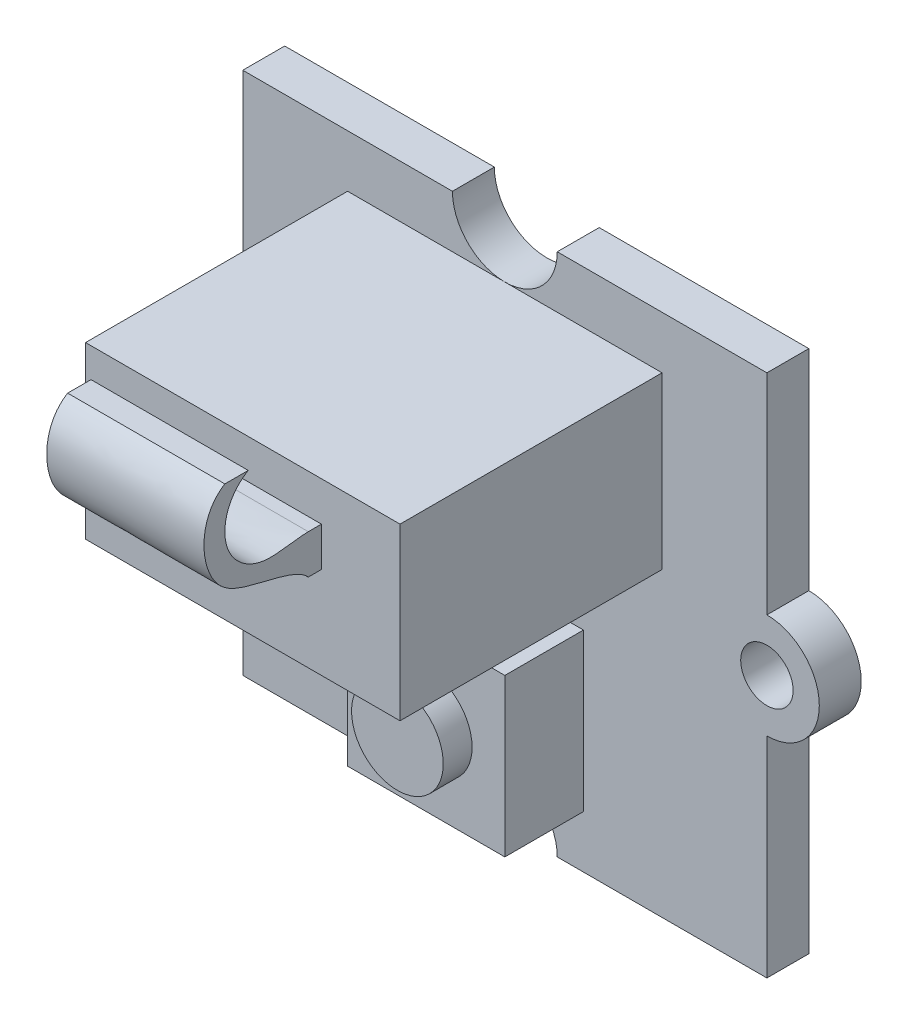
from build123d import *

# Parameters (mm, degrees)
ESQUISSE1_R        = 1
BOSS_EXTRU_1_DEPTH = 1.6
ESQUISSE2_W        = 6
ESQUISSE2_H        = 6
BOSS_EXTRU_2_DEPTH = 3
ESQUISSE3_R        = 1.75
BOSS_EXTRU_3_DEPTH = 5.7
ESQUISSE4_W        = 12
ESQUISSE4_H        = 6.5
BOSS_EXTRU_4_DEPTH = 10
BOSS_EXTRU_5_START = -3
BOSS_EXTRU_5_DEPTH = 6


with BuildPart() as part:
    # Esquisse1 → Boss.-Extru.1 (new body)
    with BuildSketch(Plane.XY):
        with BuildLine():
            Line((-10, 10), (-2, 10))
            ThreePointArc((-2, 10), (0, 8), (2, 10))
            Line((2, 10), (10, 10))
            Line((10, 10), (10, 2))
            ThreePointArc((10, 2), (12, 0), (10, -2))
            Line((10, -2), (10, -10))
            Line((10, -10), (2, -10))
            ThreePointArc((2, -10), (0, -8), (-2, -10))
            Line((-2, -10), (-10, -10))
            Line((-10, -10), (-10, -2))
            ThreePointArc((-10, -2), (-12, 0), (-10, 2))
            Line((-10, 2), (-10, 10))
        make_face()
        with Locations((-10, 0)):
            Circle(ESQUISSE1_R, mode=Mode.SUBTRACT)
        with Locations(Location((10, 0, 0), (0, 0, 180))):
            Circle(ESQUISSE1_R, mode=Mode.SUBTRACT)
    extrude(amount=BOSS_EXTRU_1_DEPTH)

    # Esquisse2 → Boss.-Extru.2 (add)
    with BuildSketch(Plane.XY.offset(1.6)):
        with Locations((0, -5)):
            Rectangle(ESQUISSE2_W, ESQUISSE2_H)
    extrude(amount=BOSS_EXTRU_2_DEPTH)

    # Esquisse3 → Boss.-Extru.3 (add)
    with BuildSketch(Plane(origin=(0, 0, 0), x_dir=(-1, 0, 0), z_dir=(0, 0, -1))):
        with Locations((0, -5)):
            Circle(ESQUISSE3_R)
    extrude(amount=-BOSS_EXTRU_3_DEPTH)

    # Esquisse4 → Boss.-Extru.4 (add)
    with BuildSketch(Plane.XY.offset(1.6)):
        with Locations((0, 4.75)):
            Rectangle(ESQUISSE4_W, ESQUISSE4_H)
    extrude(amount=BOSS_EXTRU_4_DEPTH)

    # Esquisse5 → Boss.-Extru.5 (add)
    with BuildSketch(Plane.ZY.offset(6).offset(BOSS_EXTRU_5_START)):
        with BuildLine():
            Line((11.6, 6.5), (11.6, 5))
            Line((11.6, 5), (12.1, 5))
            add(Edge.make_bspline(
                [(12.1, 5), (12.477833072, 5.44257718), (14.236583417, 5.729051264), (16.20713729, 6.5210424), (16.363485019, 9.014753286), (15.283765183, 9.670251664)],
                knots=[0, 0, 0, 0, 0.287373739, 0.49341863, 1, 1, 1, 1], degree=3))
            Line((15.283765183, 9.670251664), (14.3918544, 9.670251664))
            add(Edge.make_bspline(
                [(14.3918544, 9.670251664), (15.283258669, 9.152543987), (15.634339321, 7.448933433), (13.870766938, 6.115272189), (12.748075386, 6.487863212), (12.1, 6.5)],
                knots=[0, 0, 0, 0, 0.464496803, 0.667363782, 1, 1, 1, 1], degree=3))
            Line((12.1, 6.5), (11.6, 6.5))
        make_face()
    extrude(amount=-BOSS_EXTRU_5_DEPTH)


solid = part.part
